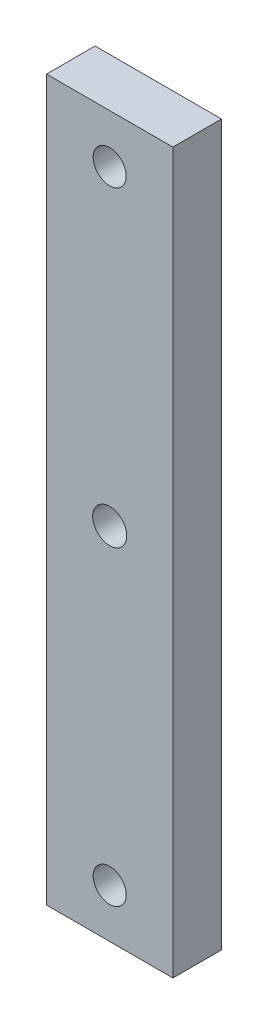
ISO-10303-21;
HEADER;
FILE_DESCRIPTION(('STEP AP214'),'2;1');
FILE_NAME('part.step','',(''),(''),'','','');
FILE_SCHEMA(('AUTOMOTIVE_DESIGN { 1 0 10303 214 1 1 1 1 }'));
ENDSEC;
DATA;
#1=APPLICATION_CONTEXT('core data for automotive mechanical design processes');
#2=APPLICATION_PROTOCOL_DEFINITION('international standard','automotive_design',2000,#1);
#3=PRODUCT_CONTEXT('',#1,'mechanical');
#4=PRODUCT('Part','Part','',(#3));
#5=PRODUCT_RELATED_PRODUCT_CATEGORY('part','',(#4));
#6=PRODUCT_DEFINITION_FORMATION('','',#4);
#7=PRODUCT_DEFINITION_CONTEXT('part definition',#1,'design');
#8=PRODUCT_DEFINITION('design','',#6,#7);
#9=PRODUCT_DEFINITION_SHAPE('','',#8);
#10=(LENGTH_UNIT() NAMED_UNIT(*) SI_UNIT(.MILLI.,.METRE.));
#11=(NAMED_UNIT(*) PLANE_ANGLE_UNIT() SI_UNIT($,.RADIAN.));
#12=(NAMED_UNIT(*) SI_UNIT($,.STERADIAN.) SOLID_ANGLE_UNIT());
#13=UNCERTAINTY_MEASURE_WITH_UNIT(LENGTH_MEASURE(1.E-05),#10,'distance_accuracy_value','');
#14=(GEOMETRIC_REPRESENTATION_CONTEXT(3) GLOBAL_UNCERTAINTY_ASSIGNED_CONTEXT((#13)) GLOBAL_UNIT_ASSIGNED_CONTEXT((#10,
#11,#12)) REPRESENTATION_CONTEXT('',''));
#15=CARTESIAN_POINT('',(0.,0.,0.));
#16=DIRECTION('',(0.,0.,1.));
#17=DIRECTION('',(1.,0.,0.));
#18=AXIS2_PLACEMENT_3D('',#15,#16,#17);
#19=CARTESIAN_POINT('',(870.,54.9999999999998,25.0000000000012));
#20=DIRECTION('',(-1.,0.,0.));
#21=DIRECTION('',(0.,0.,1.));
#22=AXIS2_PLACEMENT_3D('',#19,#20,#21);
#23=PLANE('',#22);
#24=DIRECTION('',(0.,1.,0.));
#25=VECTOR('',#24,1.);
#26=CARTESIAN_POINT('',(870.,54.9999999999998,1.22124532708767E-12));
#27=LINE('',#26,#25);
#28=CARTESIAN_POINT('',(869.999999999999,-315.,1.36002320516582E-12));
#29=VERTEX_POINT('',#28);
#30=CARTESIAN_POINT('',(870.,54.9999999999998,1.22124532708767E-12));
#31=VERTEX_POINT('',#30);
#32=EDGE_CURVE('E74',#29,#31,#27,.T.);
#33=ORIENTED_EDGE('',*,*,#32,.T.);
#34=DIRECTION('',(0.,0.,-1.));
#35=VECTOR('',#34,1.);
#36=CARTESIAN_POINT('',(870.,54.9999999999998,25.0000000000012));
#37=LINE('',#36,#35);
#38=CARTESIAN_POINT('',(870.,54.9999999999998,25.0000000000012));
#39=VERTEX_POINT('',#38);
#40=EDGE_CURVE('E11',#39,#31,#37,.T.);
#41=ORIENTED_EDGE('',*,*,#40,.F.);
#42=DIRECTION('',(0.,1.,0.));
#43=VECTOR('',#42,1.);
#44=CARTESIAN_POINT('',(870.,54.9999999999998,25.0000000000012));
#45=LINE('',#44,#43);
#46=CARTESIAN_POINT('',(869.999999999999,-315.,25.0000000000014));
#47=VERTEX_POINT('',#46);
#48=EDGE_CURVE('E97',#47,#39,#45,.T.);
#49=ORIENTED_EDGE('',*,*,#48,.F.);
#50=DIRECTION('',(0.,0.,-1.));
#51=VECTOR('',#50,1.);
#52=CARTESIAN_POINT('',(869.999999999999,-315.,25.0000000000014));
#53=LINE('',#52,#51);
#54=EDGE_CURVE('E86',#47,#29,#53,.T.);
#55=ORIENTED_EDGE('',*,*,#54,.T.);
#56=EDGE_LOOP('',(#33,#41,#49,#55));
#57=FACE_BOUND('',#56,.T.);
#58=ADVANCED_FACE('F30',(#57),#23,.F.);
#59=CARTESIAN_POINT('',(870.,54.9999999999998,25.0000000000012));
#60=DIRECTION('',(0.,-1.,0.));
#61=DIRECTION('',(1.,0.,0.));
#62=AXIS2_PLACEMENT_3D('',#59,#60,#61);
#63=PLANE('',#62);
#64=DIRECTION('',(-1.,0.,0.));
#65=VECTOR('',#64,1.);
#66=CARTESIAN_POINT('',(870.,54.9999999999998,1.22124532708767E-12));
#67=LINE('',#66,#65);
#68=CARTESIAN_POINT('',(804.999999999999,54.9999999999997,1.16573417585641E-12));
#69=VERTEX_POINT('',#68);
#70=EDGE_CURVE('E70',#31,#69,#67,.T.);
#71=ORIENTED_EDGE('',*,*,#70,.T.);
#72=DIRECTION('',(0.,0.,-1.));
#73=VECTOR('',#72,1.);
#74=CARTESIAN_POINT('',(804.999999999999,54.9999999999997,25.0000000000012));
#75=LINE('',#74,#73);
#76=CARTESIAN_POINT('',(804.999999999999,54.9999999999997,25.0000000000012));
#77=VERTEX_POINT('',#76);
#78=EDGE_CURVE('E37',#77,#69,#75,.T.);
#79=ORIENTED_EDGE('',*,*,#78,.F.);
#80=DIRECTION('',(-1.,0.,0.));
#81=VECTOR('',#80,1.);
#82=CARTESIAN_POINT('',(870.,54.9999999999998,25.0000000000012));
#83=LINE('',#82,#81);
#84=EDGE_CURVE('E82',#39,#77,#83,.T.);
#85=ORIENTED_EDGE('',*,*,#84,.F.);
#86=ORIENTED_EDGE('',*,*,#40,.T.);
#87=EDGE_LOOP('',(#71,#79,#85,#86));
#88=FACE_BOUND('',#87,.T.);
#89=ADVANCED_FACE('F81',(#88),#63,.F.);
#90=CARTESIAN_POINT('',(804.999999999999,54.9999999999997,25.0000000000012));
#91=DIRECTION('',(1.,0.,0.));
#92=DIRECTION('',(0.,0.,-1.));
#93=AXIS2_PLACEMENT_3D('',#90,#91,#92);
#94=PLANE('',#93);
#95=DIRECTION('',(0.,-1.,0.));
#96=VECTOR('',#95,1.);
#97=CARTESIAN_POINT('',(804.999999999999,54.9999999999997,1.16573417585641E-12));
#98=LINE('',#97,#96);
#99=CARTESIAN_POINT('',(805.,-315.,1.30451205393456E-12));
#100=VERTEX_POINT('',#99);
#101=EDGE_CURVE('E75',#69,#100,#98,.T.);
#102=ORIENTED_EDGE('',*,*,#101,.T.);
#103=DIRECTION('',(0.,0.,-1.));
#104=VECTOR('',#103,1.);
#105=CARTESIAN_POINT('',(805.,-315.,25.0000000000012));
#106=LINE('',#105,#104);
#107=CARTESIAN_POINT('',(805.,-315.,25.0000000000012));
#108=VERTEX_POINT('',#107);
#109=EDGE_CURVE('E103',#108,#100,#106,.T.);
#110=ORIENTED_EDGE('',*,*,#109,.F.);
#111=DIRECTION('',(0.,-1.,0.));
#112=VECTOR('',#111,1.);
#113=CARTESIAN_POINT('',(804.999999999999,54.9999999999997,25.0000000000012));
#114=LINE('',#113,#112);
#115=EDGE_CURVE('E49',#77,#108,#114,.T.);
#116=ORIENTED_EDGE('',*,*,#115,.F.);
#117=ORIENTED_EDGE('',*,*,#78,.T.);
#118=EDGE_LOOP('',(#102,#110,#116,#117));
#119=FACE_BOUND('',#118,.T.);
#120=ADVANCED_FACE('F106',(#119),#94,.F.);
#121=CARTESIAN_POINT('',(805.,-315.,25.0000000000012));
#122=DIRECTION('',(0.,1.,0.));
#123=DIRECTION('',(0.,0.,1.));
#124=AXIS2_PLACEMENT_3D('',#121,#122,#123);
#125=PLANE('',#124);
#126=DIRECTION('',(1.,0.,0.));
#127=VECTOR('',#126,1.);
#128=CARTESIAN_POINT('',(805.,-315.,1.30451205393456E-12));
#129=LINE('',#128,#127);
#130=EDGE_CURVE('E95',#100,#29,#129,.T.);
#131=ORIENTED_EDGE('',*,*,#130,.T.);
#132=ORIENTED_EDGE('',*,*,#54,.F.);
#133=DIRECTION('',(1.,0.,0.));
#134=VECTOR('',#133,1.);
#135=CARTESIAN_POINT('',(805.,-315.,25.0000000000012));
#136=LINE('',#135,#134);
#137=EDGE_CURVE('E44',#108,#47,#136,.T.);
#138=ORIENTED_EDGE('',*,*,#137,.F.);
#139=ORIENTED_EDGE('',*,*,#109,.T.);
#140=EDGE_LOOP('',(#131,#132,#138,#139));
#141=FACE_BOUND('',#140,.T.);
#142=ADVANCED_FACE('F108',(#141),#125,.F.);
#143=CARTESIAN_POINT('',(869.999999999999,-315.,25.0000000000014));
#144=DIRECTION('',(0.,0.,1.));
#145=DIRECTION('',(1.,0.,0.));
#146=AXIS2_PLACEMENT_3D('',#143,#144,#145);
#147=PLANE('',#146);
#148=CARTESIAN_POINT('',(837.499999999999,-130.,25.0000000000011));
#149=DIRECTION('',(0.,0.,1.));
#150=DIRECTION('',(1.,0.,0.));
#151=AXIS2_PLACEMENT_3D('',#148,#149,#150);
#152=CIRCLE('',#151,8.75000000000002);
#153=CARTESIAN_POINT('',(846.249999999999,-130.,25.0000000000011));
#154=VERTEX_POINT('',#153);
#155=EDGE_CURVE('E173',#154,#154,#152,.T.);
#156=ORIENTED_EDGE('',*,*,#155,.F.);
#157=EDGE_LOOP('',(#156));
#158=FACE_BOUND('',#157,.T.);
#159=CARTESIAN_POINT('',(837.5,-290.,25.0000000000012));
#160=DIRECTION('',(0.,0.,1.));
#161=DIRECTION('',(1.,0.,0.));
#162=AXIS2_PLACEMENT_3D('',#159,#160,#161);
#163=CIRCLE('',#162,8.49999999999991);
#164=CARTESIAN_POINT('',(846.,-290.,25.0000000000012));
#165=VERTEX_POINT('',#164);
#166=EDGE_CURVE('E175',#165,#165,#163,.T.);
#167=ORIENTED_EDGE('',*,*,#166,.F.);
#168=EDGE_LOOP('',(#167));
#169=FACE_BOUND('',#168,.T.);
#170=CARTESIAN_POINT('',(837.499999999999,29.9999999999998,25.0000000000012));
#171=DIRECTION('',(0.,0.,1.));
#172=DIRECTION('',(1.,0.,0.));
#173=AXIS2_PLACEMENT_3D('',#170,#171,#172);
#174=CIRCLE('',#173,8.4999999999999);
#175=CARTESIAN_POINT('',(845.999999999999,29.9999999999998,25.0000000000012));
#176=VERTEX_POINT('',#175);
#177=EDGE_CURVE('E90',#176,#176,#174,.T.);
#178=ORIENTED_EDGE('',*,*,#177,.F.);
#179=EDGE_LOOP('',(#178));
#180=FACE_BOUND('',#179,.T.);
#181=ORIENTED_EDGE('',*,*,#48,.T.);
#182=ORIENTED_EDGE('',*,*,#84,.T.);
#183=ORIENTED_EDGE('',*,*,#115,.T.);
#184=ORIENTED_EDGE('',*,*,#137,.T.);
#185=EDGE_LOOP('',(#181,#182,#183,#184));
#186=FACE_BOUND('',#185,.T.);
#187=ADVANCED_FACE('F109',(#158,#169,#180,#186),#147,.T.);
#188=CARTESIAN_POINT('',(869.999999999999,-315.,1.36002320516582E-12));
#189=DIRECTION('',(0.,0.,1.));
#190=DIRECTION('',(1.,0.,0.));
#191=AXIS2_PLACEMENT_3D('',#188,#189,#190);
#192=PLANE('',#191);
#193=CARTESIAN_POINT('',(837.499999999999,-130.,1.0547118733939E-12));
#194=DIRECTION('',(0.,0.,1.));
#195=DIRECTION('',(1.,0.,0.));
#196=AXIS2_PLACEMENT_3D('',#193,#194,#195);
#197=CIRCLE('',#196,8.75000000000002);
#198=CARTESIAN_POINT('',(846.249999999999,-130.,1.06855496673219E-12));
#199=VERTEX_POINT('',#198);
#200=EDGE_CURVE('E171',#199,#199,#197,.T.);
#201=ORIENTED_EDGE('',*,*,#200,.T.);
#202=EDGE_LOOP('',(#201));
#203=FACE_BOUND('',#202,.T.);
#204=CARTESIAN_POINT('',(837.5,-290.,1.33226762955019E-12));
#205=DIRECTION('',(0.,0.,1.));
#206=DIRECTION('',(1.,0.,0.));
#207=AXIS2_PLACEMENT_3D('',#204,#205,#206);
#208=CIRCLE('',#207,8.49999999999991);
#209=CARTESIAN_POINT('',(846.,-290.,1.34571520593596E-12));
#210=VERTEX_POINT('',#209);
#211=EDGE_CURVE('E180',#210,#210,#208,.T.);
#212=ORIENTED_EDGE('',*,*,#211,.T.);
#213=EDGE_LOOP('',(#212));
#214=FACE_BOUND('',#213,.T.);
#215=CARTESIAN_POINT('',(837.499999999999,29.9999999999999,1.22124532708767E-12));
#216=DIRECTION('',(0.,0.,1.));
#217=DIRECTION('',(1.,0.,0.));
#218=AXIS2_PLACEMENT_3D('',#215,#216,#217);
#219=CIRCLE('',#218,8.4999999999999);
#220=CARTESIAN_POINT('',(845.999999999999,29.9999999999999,1.23469290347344E-12));
#221=VERTEX_POINT('',#220);
#222=EDGE_CURVE('E87',#221,#221,#219,.T.);
#223=ORIENTED_EDGE('',*,*,#222,.T.);
#224=EDGE_LOOP('',(#223));
#225=FACE_BOUND('',#224,.T.);
#226=ORIENTED_EDGE('',*,*,#32,.F.);
#227=ORIENTED_EDGE('',*,*,#130,.F.);
#228=ORIENTED_EDGE('',*,*,#101,.F.);
#229=ORIENTED_EDGE('',*,*,#70,.F.);
#230=EDGE_LOOP('',(#226,#227,#228,#229));
#231=FACE_BOUND('',#230,.T.);
#232=ADVANCED_FACE('F71',(#203,#214,#225,#231),#192,.F.);
#233=CARTESIAN_POINT('',(837.499999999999,29.9999999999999,1.22124532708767E-12));
#234=DIRECTION('',(0.,0.,1.));
#235=DIRECTION('',(1.,0.,0.));
#236=AXIS2_PLACEMENT_3D('',#233,#234,#235);
#237=CYLINDRICAL_SURFACE('',#236,8.4999999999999);
#238=ORIENTED_EDGE('',*,*,#222,.F.);
#239=EDGE_LOOP('',(#238));
#240=FACE_BOUND('',#239,.T.);
#241=ORIENTED_EDGE('',*,*,#177,.T.);
#242=EDGE_LOOP('',(#241));
#243=FACE_BOUND('',#242,.T.);
#244=ADVANCED_FACE('F117',(#240,#243),#237,.F.);
#245=CARTESIAN_POINT('',(837.5,-290.,1.33226762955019E-12));
#246=DIRECTION('',(0.,0.,1.));
#247=DIRECTION('',(1.,0.,0.));
#248=AXIS2_PLACEMENT_3D('',#245,#246,#247);
#249=CYLINDRICAL_SURFACE('',#248,8.49999999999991);
#250=ORIENTED_EDGE('',*,*,#211,.F.);
#251=EDGE_LOOP('',(#250));
#252=FACE_BOUND('',#251,.T.);
#253=ORIENTED_EDGE('',*,*,#166,.T.);
#254=EDGE_LOOP('',(#253));
#255=FACE_BOUND('',#254,.T.);
#256=ADVANCED_FACE('F150',(#252,#255),#249,.F.);
#257=CARTESIAN_POINT('',(837.499999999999,-130.,1.0547118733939E-12));
#258=DIRECTION('',(0.,0.,1.));
#259=DIRECTION('',(1.,0.,0.));
#260=AXIS2_PLACEMENT_3D('',#257,#258,#259);
#261=CYLINDRICAL_SURFACE('',#260,8.75000000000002);
#262=ORIENTED_EDGE('',*,*,#200,.F.);
#263=EDGE_LOOP('',(#262));
#264=FACE_BOUND('',#263,.T.);
#265=ORIENTED_EDGE('',*,*,#155,.T.);
#266=EDGE_LOOP('',(#265));
#267=FACE_BOUND('',#266,.T.);
#268=ADVANCED_FACE('F158',(#264,#267),#261,.F.);
#269=CLOSED_SHELL('',(#58,#89,#120,#142,#187,#232,#244,#256,#268));
#270=MANIFOLD_SOLID_BREP('B2',#269);
#271=ADVANCED_BREP_SHAPE_REPRESENTATION('',(#18,#270),#14);
#272=SHAPE_DEFINITION_REPRESENTATION(#9,#271);
ENDSEC;
END-ISO-10303-21;
